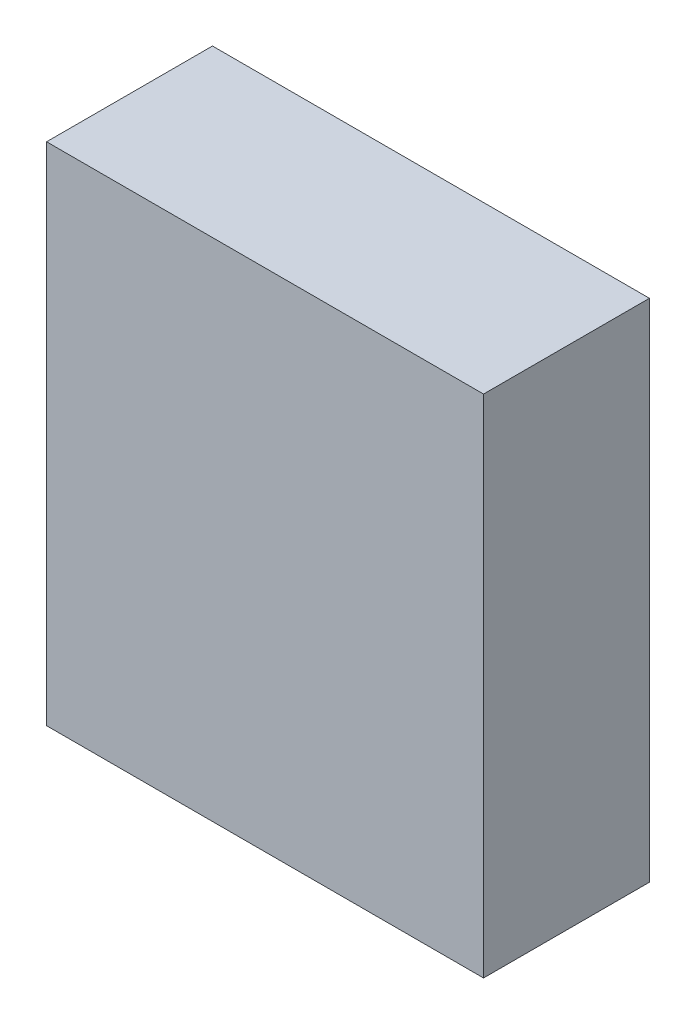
from build123d import *

# Parameters (mm, degrees)
CROQUIS10_W    = 432
CROQUIS10_H    = 164
EXTRUIR9_DEPTH = 500


with BuildPart() as part:
    # Croquis10 → Extruir9 (new body)
    with BuildSketch(Plane(origin=(0, 0, 0), x_dir=(1, 0, 0), z_dir=(0, 1, 0))):
        Rectangle(CROQUIS10_W, CROQUIS10_H)
    extrude(amount=EXTRUIR9_DEPTH)


solid = part.part
